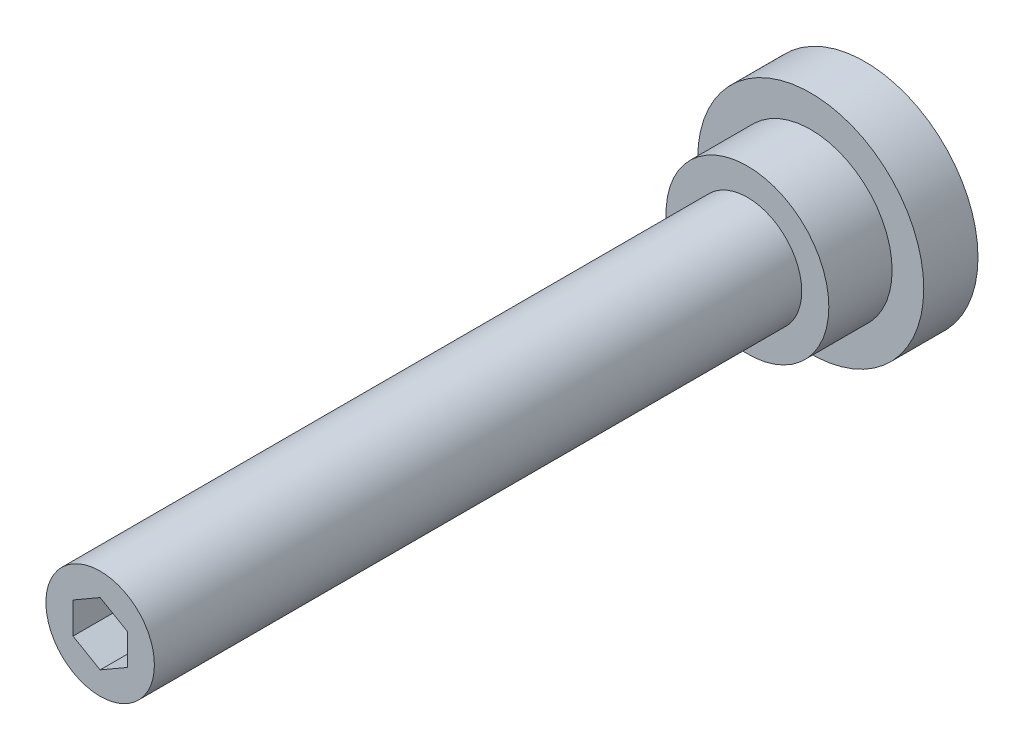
ISO-10303-21;
HEADER;
FILE_DESCRIPTION(('STEP AP214'),'2;1');
FILE_NAME('part.step','',(''),(''),'','','');
FILE_SCHEMA(('AUTOMOTIVE_DESIGN { 1 0 10303 214 1 1 1 1 }'));
ENDSEC;
DATA;
#1=APPLICATION_CONTEXT('core data for automotive mechanical design processes');
#2=APPLICATION_PROTOCOL_DEFINITION('international standard','automotive_design',2000,#1);
#3=PRODUCT_CONTEXT('',#1,'mechanical');
#4=PRODUCT('Part','Part','',(#3));
#5=PRODUCT_RELATED_PRODUCT_CATEGORY('part','',(#4));
#6=PRODUCT_DEFINITION_FORMATION('','',#4);
#7=PRODUCT_DEFINITION_CONTEXT('part definition',#1,'design');
#8=PRODUCT_DEFINITION('design','',#6,#7);
#9=PRODUCT_DEFINITION_SHAPE('','',#8);
#10=(LENGTH_UNIT() NAMED_UNIT(*) SI_UNIT(.MILLI.,.METRE.));
#11=(NAMED_UNIT(*) PLANE_ANGLE_UNIT() SI_UNIT($,.RADIAN.));
#12=(NAMED_UNIT(*) SI_UNIT($,.STERADIAN.) SOLID_ANGLE_UNIT());
#13=UNCERTAINTY_MEASURE_WITH_UNIT(LENGTH_MEASURE(1.E-05),#10,'distance_accuracy_value','');
#14=(GEOMETRIC_REPRESENTATION_CONTEXT(3) GLOBAL_UNCERTAINTY_ASSIGNED_CONTEXT((#13)) GLOBAL_UNIT_ASSIGNED_CONTEXT((#10,
#11,#12)) REPRESENTATION_CONTEXT('',''));
#15=CARTESIAN_POINT('',(0.,0.,0.));
#16=DIRECTION('',(0.,0.,1.));
#17=DIRECTION('',(1.,0.,0.));
#18=AXIS2_PLACEMENT_3D('',#15,#16,#17);
#19=CARTESIAN_POINT('',(0.,0.,84.6));
#20=DIRECTION('',(0.,0.,1.));
#21=DIRECTION('',(1.,0.,0.));
#22=AXIS2_PLACEMENT_3D('',#19,#20,#21);
#23=PLANE('',#22);
#24=DIRECTION('',(-0.866025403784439,0.5,0.));
#25=VECTOR('',#24,1.);
#26=CARTESIAN_POINT('',(3.,1.73205080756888,84.6));
#27=LINE('',#26,#25);
#28=CARTESIAN_POINT('',(3.,1.73205080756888,84.6));
#29=VERTEX_POINT('',#28);
#30=CARTESIAN_POINT('',(0.,3.46410161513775,84.6));
#31=VERTEX_POINT('',#30);
#32=EDGE_CURVE('E28',#29,#31,#27,.T.);
#33=ORIENTED_EDGE('',*,*,#32,.F.);
#34=DIRECTION('',(0.,1.,0.));
#35=VECTOR('',#34,1.);
#36=CARTESIAN_POINT('',(3.,-1.73205080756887,84.6));
#37=LINE('',#36,#35);
#38=CARTESIAN_POINT('',(3.,-1.73205080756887,84.6));
#39=VERTEX_POINT('',#38);
#40=EDGE_CURVE('E111',#39,#29,#37,.T.);
#41=ORIENTED_EDGE('',*,*,#40,.F.);
#42=DIRECTION('',(0.866025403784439,0.5,0.));
#43=VECTOR('',#42,1.);
#44=CARTESIAN_POINT('',(0.,-3.46410161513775,84.6));
#45=LINE('',#44,#43);
#46=CARTESIAN_POINT('',(0.,-3.46410161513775,84.6));
#47=VERTEX_POINT('',#46);
#48=EDGE_CURVE('E109',#47,#39,#45,.T.);
#49=ORIENTED_EDGE('',*,*,#48,.F.);
#50=DIRECTION('',(0.866025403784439,-0.5,0.));
#51=VECTOR('',#50,1.);
#52=CARTESIAN_POINT('',(-3.,-1.73205080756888,84.6));
#53=LINE('',#52,#51);
#54=CARTESIAN_POINT('',(-3.,-1.73205080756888,84.6));
#55=VERTEX_POINT('',#54);
#56=EDGE_CURVE('E76',#55,#47,#53,.T.);
#57=ORIENTED_EDGE('',*,*,#56,.F.);
#58=DIRECTION('',(0.,-1.,0.));
#59=VECTOR('',#58,1.);
#60=CARTESIAN_POINT('',(-3.,1.73205080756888,84.6));
#61=LINE('',#60,#59);
#62=CARTESIAN_POINT('',(-3.,1.73205080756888,84.6));
#63=VERTEX_POINT('',#62);
#64=EDGE_CURVE('E105',#63,#55,#61,.T.);
#65=ORIENTED_EDGE('',*,*,#64,.F.);
#66=DIRECTION('',(-0.866025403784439,-0.5,0.));
#67=VECTOR('',#66,1.);
#68=CARTESIAN_POINT('',(0.,3.46410161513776,84.6));
#69=LINE('',#68,#67);
#70=EDGE_CURVE('E102',#31,#63,#69,.T.);
#71=ORIENTED_EDGE('',*,*,#70,.F.);
#72=EDGE_LOOP('',(#33,#41,#49,#57,#65,#71));
#73=FACE_BOUND('',#72,.T.);
#74=CARTESIAN_POINT('',(0.,0.,84.6));
#75=DIRECTION('',(0.,0.,1.));
#76=DIRECTION('',(1.,0.,0.));
#77=AXIS2_PLACEMENT_3D('',#74,#75,#76);
#78=CIRCLE('',#77,6.);
#79=CARTESIAN_POINT('',(6.,0.,84.6));
#80=VERTEX_POINT('',#79);
#81=EDGE_CURVE('E9',#80,#80,#78,.T.);
#82=ORIENTED_EDGE('',*,*,#81,.T.);
#83=EDGE_LOOP('',(#82));
#84=FACE_BOUND('',#83,.T.);
#85=ADVANCED_FACE('F14',(#73,#84),#23,.T.);
#86=CARTESIAN_POINT('',(0.,0.,30.));
#87=DIRECTION('',(0.,0.,1.));
#88=DIRECTION('',(1.,0.,0.));
#89=AXIS2_PLACEMENT_3D('',#86,#87,#88);
#90=CYLINDRICAL_SURFACE('',#89,6.);
#91=CARTESIAN_POINT('',(0.,0.,13.));
#92=DIRECTION('',(0.,0.,1.));
#93=DIRECTION('',(1.,0.,0.));
#94=AXIS2_PLACEMENT_3D('',#91,#92,#93);
#95=CIRCLE('',#94,6.);
#96=CARTESIAN_POINT('',(6.,0.,13.));
#97=VERTEX_POINT('',#96);
#98=EDGE_CURVE('E21',#97,#97,#95,.T.);
#99=ORIENTED_EDGE('',*,*,#98,.T.);
#100=EDGE_LOOP('',(#99));
#101=FACE_BOUND('',#100,.T.);
#102=ORIENTED_EDGE('',*,*,#81,.F.);
#103=EDGE_LOOP('',(#102));
#104=FACE_BOUND('',#103,.T.);
#105=ADVANCED_FACE('F134',(#101,#104),#90,.T.);
#106=CARTESIAN_POINT('',(-6.,0.,13.));
#107=DIRECTION('',(0.,0.,1.));
#108=DIRECTION('',(1.,0.,0.));
#109=AXIS2_PLACEMENT_3D('',#106,#107,#108);
#110=PLANE('',#109);
#111=CARTESIAN_POINT('',(0.,0.,13.));
#112=DIRECTION('',(0.,0.,1.));
#113=DIRECTION('',(1.,0.,0.));
#114=AXIS2_PLACEMENT_3D('',#111,#112,#113);
#115=CIRCLE('',#114,9.);
#116=CARTESIAN_POINT('',(9.,0.,13.));
#117=VERTEX_POINT('',#116);
#118=EDGE_CURVE('E129',#117,#117,#115,.T.);
#119=ORIENTED_EDGE('',*,*,#118,.T.);
#120=EDGE_LOOP('',(#119));
#121=FACE_BOUND('',#120,.T.);
#122=ORIENTED_EDGE('',*,*,#98,.F.);
#123=EDGE_LOOP('',(#122));
#124=FACE_BOUND('',#123,.T.);
#125=ADVANCED_FACE('F137',(#121,#124),#110,.T.);
#126=CARTESIAN_POINT('',(0.,0.,30.));
#127=DIRECTION('',(0.,0.,1.));
#128=DIRECTION('',(1.,0.,0.));
#129=AXIS2_PLACEMENT_3D('',#126,#127,#128);
#130=CYLINDRICAL_SURFACE('',#129,9.);
#131=CARTESIAN_POINT('',(0.,0.,6.));
#132=DIRECTION('',(0.,0.,1.));
#133=DIRECTION('',(1.,0.,0.));
#134=AXIS2_PLACEMENT_3D('',#131,#132,#133);
#135=CIRCLE('',#134,9.);
#136=CARTESIAN_POINT('',(9.,0.,6.));
#137=VERTEX_POINT('',#136);
#138=EDGE_CURVE('E126',#137,#137,#135,.T.);
#139=ORIENTED_EDGE('',*,*,#138,.T.);
#140=EDGE_LOOP('',(#139));
#141=FACE_BOUND('',#140,.T.);
#142=ORIENTED_EDGE('',*,*,#118,.F.);
#143=EDGE_LOOP('',(#142));
#144=FACE_BOUND('',#143,.T.);
#145=ADVANCED_FACE('F139',(#141,#144),#130,.T.);
#146=CARTESIAN_POINT('',(-9.,0.,6.));
#147=DIRECTION('',(0.,0.,1.));
#148=DIRECTION('',(1.,0.,0.));
#149=AXIS2_PLACEMENT_3D('',#146,#147,#148);
#150=PLANE('',#149);
#151=CARTESIAN_POINT('',(0.,0.,6.));
#152=DIRECTION('',(0.,0.,1.));
#153=DIRECTION('',(1.,0.,0.));
#154=AXIS2_PLACEMENT_3D('',#151,#152,#153);
#155=CIRCLE('',#154,12.5);
#156=CARTESIAN_POINT('',(12.5,0.,6.));
#157=VERTEX_POINT('',#156);
#158=EDGE_CURVE('E123',#157,#157,#155,.T.);
#159=ORIENTED_EDGE('',*,*,#158,.T.);
#160=EDGE_LOOP('',(#159));
#161=FACE_BOUND('',#160,.T.);
#162=ORIENTED_EDGE('',*,*,#138,.F.);
#163=EDGE_LOOP('',(#162));
#164=FACE_BOUND('',#163,.T.);
#165=ADVANCED_FACE('F147',(#161,#164),#150,.T.);
#166=CARTESIAN_POINT('',(0.,0.,30.));
#167=DIRECTION('',(0.,0.,1.));
#168=DIRECTION('',(1.,0.,0.));
#169=AXIS2_PLACEMENT_3D('',#166,#167,#168);
#170=CYLINDRICAL_SURFACE('',#169,12.5);
#171=CARTESIAN_POINT('',(0.,0.,0.));
#172=DIRECTION('',(0.,0.,1.));
#173=DIRECTION('',(1.,0.,0.));
#174=AXIS2_PLACEMENT_3D('',#171,#172,#173);
#175=CIRCLE('',#174,12.5);
#176=CARTESIAN_POINT('',(12.5,0.,0.));
#177=VERTEX_POINT('',#176);
#178=EDGE_CURVE('E115',#177,#177,#175,.T.);
#179=ORIENTED_EDGE('',*,*,#178,.T.);
#180=EDGE_LOOP('',(#179));
#181=FACE_BOUND('',#180,.T.);
#182=ORIENTED_EDGE('',*,*,#158,.F.);
#183=EDGE_LOOP('',(#182));
#184=FACE_BOUND('',#183,.T.);
#185=ADVANCED_FACE('F172',(#181,#184),#170,.T.);
#186=CARTESIAN_POINT('',(-12.5,0.,0.));
#187=DIRECTION('',(0.,0.,-1.));
#188=DIRECTION('',(-1.,0.,0.));
#189=AXIS2_PLACEMENT_3D('',#186,#187,#188);
#190=PLANE('',#189);
#191=ORIENTED_EDGE('',*,*,#178,.F.);
#192=EDGE_LOOP('',(#191));
#193=FACE_BOUND('',#192,.T.);
#194=ADVANCED_FACE('F165',(#193),#190,.T.);
#195=CARTESIAN_POINT('',(3.,1.73205080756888,79.6));
#196=DIRECTION('',(0.5,0.866025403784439,0.));
#197=DIRECTION('',(-0.866025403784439,0.5,0.));
#198=AXIS2_PLACEMENT_3D('',#195,#196,#197);
#199=PLANE('',#198);
#200=ORIENTED_EDGE('',*,*,#32,.T.);
#201=DIRECTION('',(0.,0.,1.));
#202=VECTOR('',#201,1.);
#203=CARTESIAN_POINT('',(0.,3.46410161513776,79.6));
#204=LINE('',#203,#202);
#205=CARTESIAN_POINT('',(0.,3.46410161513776,79.6));
#206=VERTEX_POINT('',#205);
#207=EDGE_CURVE('E58',#206,#31,#204,.T.);
#208=ORIENTED_EDGE('',*,*,#207,.F.);
#209=DIRECTION('',(-0.866025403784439,0.5,0.));
#210=VECTOR('',#209,1.);
#211=CARTESIAN_POINT('',(3.,1.73205080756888,79.6));
#212=LINE('',#211,#210);
#213=CARTESIAN_POINT('',(3.,1.73205080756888,79.6));
#214=VERTEX_POINT('',#213);
#215=EDGE_CURVE('E113',#214,#206,#212,.T.);
#216=ORIENTED_EDGE('',*,*,#215,.F.);
#217=DIRECTION('',(0.,0.,1.));
#218=VECTOR('',#217,1.);
#219=CARTESIAN_POINT('',(3.,1.73205080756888,79.6));
#220=LINE('',#219,#218);
#221=EDGE_CURVE('E36',#214,#29,#220,.T.);
#222=ORIENTED_EDGE('',*,*,#221,.T.);
#223=EDGE_LOOP('',(#200,#208,#216,#222));
#224=FACE_BOUND('',#223,.T.);
#225=ADVANCED_FACE('F162',(#224),#199,.F.);
#226=CARTESIAN_POINT('',(3.,-1.73205080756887,79.6));
#227=DIRECTION('',(1.,0.,0.));
#228=DIRECTION('',(0.,1.,0.));
#229=AXIS2_PLACEMENT_3D('',#226,#227,#228);
#230=PLANE('',#229);
#231=ORIENTED_EDGE('',*,*,#40,.T.);
#232=ORIENTED_EDGE('',*,*,#221,.F.);
#233=DIRECTION('',(0.,1.,0.));
#234=VECTOR('',#233,1.);
#235=CARTESIAN_POINT('',(3.,-1.73205080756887,79.6));
#236=LINE('',#235,#234);
#237=CARTESIAN_POINT('',(3.,-1.73205080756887,79.6));
#238=VERTEX_POINT('',#237);
#239=EDGE_CURVE('E88',#238,#214,#236,.T.);
#240=ORIENTED_EDGE('',*,*,#239,.F.);
#241=DIRECTION('',(0.,0.,1.));
#242=VECTOR('',#241,1.);
#243=CARTESIAN_POINT('',(3.,-1.73205080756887,79.6));
#244=LINE('',#243,#242);
#245=EDGE_CURVE('E80',#238,#39,#244,.T.);
#246=ORIENTED_EDGE('',*,*,#245,.T.);
#247=EDGE_LOOP('',(#231,#232,#240,#246));
#248=FACE_BOUND('',#247,.T.);
#249=ADVANCED_FACE('F164',(#248),#230,.F.);
#250=CARTESIAN_POINT('',(0.,-3.46410161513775,79.6));
#251=DIRECTION('',(0.5,-0.866025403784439,0.));
#252=DIRECTION('',(0.866025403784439,0.5,0.));
#253=AXIS2_PLACEMENT_3D('',#250,#251,#252);
#254=PLANE('',#253);
#255=ORIENTED_EDGE('',*,*,#48,.T.);
#256=ORIENTED_EDGE('',*,*,#245,.F.);
#257=DIRECTION('',(0.866025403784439,0.5,0.));
#258=VECTOR('',#257,1.);
#259=CARTESIAN_POINT('',(0.,-3.46410161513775,79.6));
#260=LINE('',#259,#258);
#261=CARTESIAN_POINT('',(0.,-3.46410161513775,79.6));
#262=VERTEX_POINT('',#261);
#263=EDGE_CURVE('E84',#262,#238,#260,.T.);
#264=ORIENTED_EDGE('',*,*,#263,.F.);
#265=DIRECTION('',(0.,0.,1.));
#266=VECTOR('',#265,1.);
#267=CARTESIAN_POINT('',(0.,-3.46410161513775,79.6));
#268=LINE('',#267,#266);
#269=EDGE_CURVE('E69',#262,#47,#268,.T.);
#270=ORIENTED_EDGE('',*,*,#269,.T.);
#271=EDGE_LOOP('',(#255,#256,#264,#270));
#272=FACE_BOUND('',#271,.T.);
#273=ADVANCED_FACE('F85',(#272),#254,.F.);
#274=CARTESIAN_POINT('',(-3.,-1.73205080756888,79.6));
#275=DIRECTION('',(-0.5,-0.866025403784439,0.));
#276=DIRECTION('',(0.866025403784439,-0.5,0.));
#277=AXIS2_PLACEMENT_3D('',#274,#275,#276);
#278=PLANE('',#277);
#279=ORIENTED_EDGE('',*,*,#56,.T.);
#280=ORIENTED_EDGE('',*,*,#269,.F.);
#281=DIRECTION('',(0.866025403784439,-0.5,0.));
#282=VECTOR('',#281,1.);
#283=CARTESIAN_POINT('',(-3.,-1.73205080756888,79.6));
#284=LINE('',#283,#282);
#285=CARTESIAN_POINT('',(-3.,-1.73205080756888,79.6));
#286=VERTEX_POINT('',#285);
#287=EDGE_CURVE('E73',#286,#262,#284,.T.);
#288=ORIENTED_EDGE('',*,*,#287,.F.);
#289=DIRECTION('',(0.,0.,1.));
#290=VECTOR('',#289,1.);
#291=CARTESIAN_POINT('',(-3.,-1.73205080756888,79.6));
#292=LINE('',#291,#290);
#293=EDGE_CURVE('E81',#286,#55,#292,.T.);
#294=ORIENTED_EDGE('',*,*,#293,.T.);
#295=EDGE_LOOP('',(#279,#280,#288,#294));
#296=FACE_BOUND('',#295,.T.);
#297=ADVANCED_FACE('F71',(#296),#278,.F.);
#298=CARTESIAN_POINT('',(-3.,1.73205080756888,79.6));
#299=DIRECTION('',(-1.,0.,0.));
#300=DIRECTION('',(0.,-1.,0.));
#301=AXIS2_PLACEMENT_3D('',#298,#299,#300);
#302=PLANE('',#301);
#303=ORIENTED_EDGE('',*,*,#64,.T.);
#304=ORIENTED_EDGE('',*,*,#293,.F.);
#305=DIRECTION('',(0.,-1.,0.));
#306=VECTOR('',#305,1.);
#307=CARTESIAN_POINT('',(-3.,1.73205080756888,79.6));
#308=LINE('',#307,#306);
#309=CARTESIAN_POINT('',(-3.,1.73205080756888,79.6));
#310=VERTEX_POINT('',#309);
#311=EDGE_CURVE('E94',#310,#286,#308,.T.);
#312=ORIENTED_EDGE('',*,*,#311,.F.);
#313=DIRECTION('',(0.,0.,1.));
#314=VECTOR('',#313,1.);
#315=CARTESIAN_POINT('',(-3.,1.73205080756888,79.6));
#316=LINE('',#315,#314);
#317=EDGE_CURVE('E118',#310,#63,#316,.T.);
#318=ORIENTED_EDGE('',*,*,#317,.T.);
#319=EDGE_LOOP('',(#303,#304,#312,#318));
#320=FACE_BOUND('',#319,.T.);
#321=ADVANCED_FACE('F237',(#320),#302,.F.);
#322=CARTESIAN_POINT('',(0.,3.46410161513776,79.6));
#323=DIRECTION('',(-0.5,0.866025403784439,0.));
#324=DIRECTION('',(-0.866025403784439,-0.5,0.));
#325=AXIS2_PLACEMENT_3D('',#322,#323,#324);
#326=PLANE('',#325);
#327=ORIENTED_EDGE('',*,*,#70,.T.);
#328=ORIENTED_EDGE('',*,*,#317,.F.);
#329=DIRECTION('',(-0.866025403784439,-0.5,0.));
#330=VECTOR('',#329,1.);
#331=CARTESIAN_POINT('',(0.,3.46410161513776,79.6));
#332=LINE('',#331,#330);
#333=EDGE_CURVE('E96',#206,#310,#332,.T.);
#334=ORIENTED_EDGE('',*,*,#333,.F.);
#335=ORIENTED_EDGE('',*,*,#207,.T.);
#336=EDGE_LOOP('',(#327,#328,#334,#335));
#337=FACE_BOUND('',#336,.T.);
#338=ADVANCED_FACE('F160',(#337),#326,.F.);
#339=CARTESIAN_POINT('',(0.,3.46410161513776,79.6));
#340=DIRECTION('',(0.,0.,1.));
#341=DIRECTION('',(1.,0.,0.));
#342=AXIS2_PLACEMENT_3D('',#339,#340,#341);
#343=PLANE('',#342);
#344=ORIENTED_EDGE('',*,*,#215,.T.);
#345=ORIENTED_EDGE('',*,*,#333,.T.);
#346=ORIENTED_EDGE('',*,*,#311,.T.);
#347=ORIENTED_EDGE('',*,*,#287,.T.);
#348=ORIENTED_EDGE('',*,*,#263,.T.);
#349=ORIENTED_EDGE('',*,*,#239,.T.);
#350=EDGE_LOOP('',(#344,#345,#346,#347,#348,#349));
#351=FACE_BOUND('',#350,.T.);
#352=ADVANCED_FACE('F91',(#351),#343,.T.);
#353=CLOSED_SHELL('',(#85,#105,#125,#145,#165,#185,#194,#225,#249,#273,#297,#321,#338,#352));
#354=MANIFOLD_SOLID_BREP('B1',#353);
#355=ADVANCED_BREP_SHAPE_REPRESENTATION('',(#18,#354),#14);
#356=SHAPE_DEFINITION_REPRESENTATION(#9,#355);
ENDSEC;
END-ISO-10303-21;
